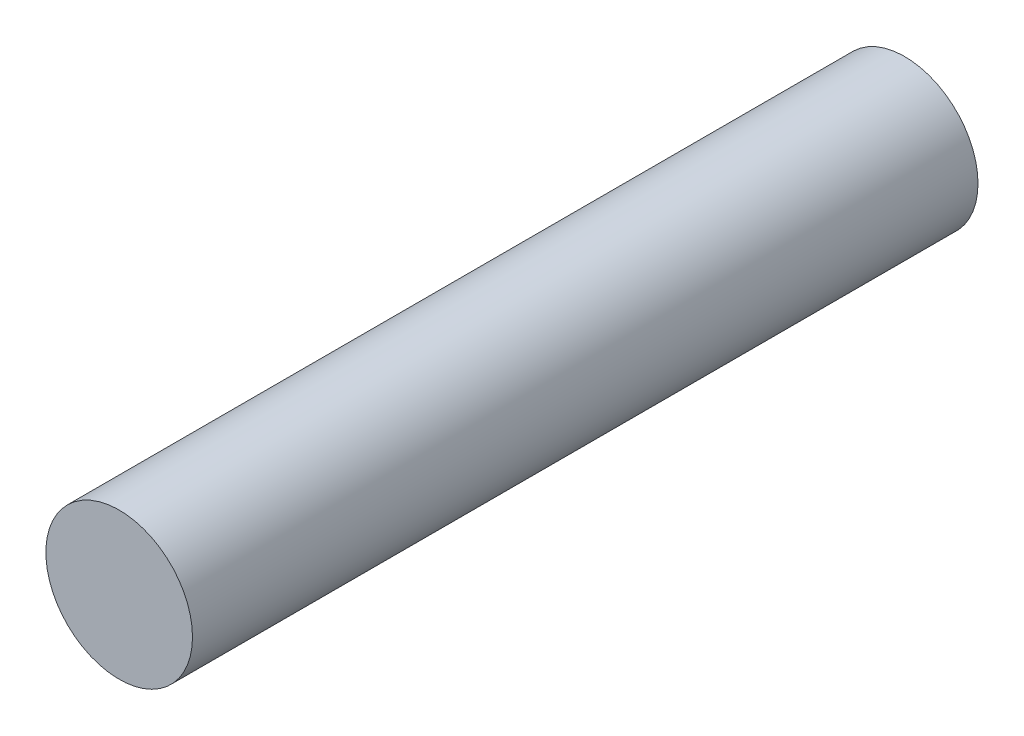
ISO-10303-21;
HEADER;
FILE_DESCRIPTION(('STEP AP214'),'2;1');
FILE_NAME('part.step','',(''),(''),'','','');
FILE_SCHEMA(('AUTOMOTIVE_DESIGN { 1 0 10303 214 1 1 1 1 }'));
ENDSEC;
DATA;
#1=APPLICATION_CONTEXT('core data for automotive mechanical design processes');
#2=APPLICATION_PROTOCOL_DEFINITION('international standard','automotive_design',2000,#1);
#3=PRODUCT_CONTEXT('',#1,'mechanical');
#4=PRODUCT('Part','Part','',(#3));
#5=PRODUCT_RELATED_PRODUCT_CATEGORY('part','',(#4));
#6=PRODUCT_DEFINITION_FORMATION('','',#4);
#7=PRODUCT_DEFINITION_CONTEXT('part definition',#1,'design');
#8=PRODUCT_DEFINITION('design','',#6,#7);
#9=PRODUCT_DEFINITION_SHAPE('','',#8);
#10=(LENGTH_UNIT() NAMED_UNIT(*) SI_UNIT(.MILLI.,.METRE.));
#11=(NAMED_UNIT(*) PLANE_ANGLE_UNIT() SI_UNIT($,.RADIAN.));
#12=(NAMED_UNIT(*) SI_UNIT($,.STERADIAN.) SOLID_ANGLE_UNIT());
#13=UNCERTAINTY_MEASURE_WITH_UNIT(LENGTH_MEASURE(1.E-05),#10,'distance_accuracy_value','');
#14=(GEOMETRIC_REPRESENTATION_CONTEXT(3) GLOBAL_UNCERTAINTY_ASSIGNED_CONTEXT((#13)) GLOBAL_UNIT_ASSIGNED_CONTEXT((#10,
#11,#12)) REPRESENTATION_CONTEXT('',''));
#15=CARTESIAN_POINT('',(0.,0.,0.));
#16=DIRECTION('',(0.,0.,1.));
#17=DIRECTION('',(1.,0.,0.));
#18=AXIS2_PLACEMENT_3D('',#15,#16,#17);
#19=CARTESIAN_POINT('',(0.,0.,75.));
#20=DIRECTION('',(0.,0.,-1.));
#21=DIRECTION('',(-1.,0.,0.));
#22=AXIS2_PLACEMENT_3D('',#19,#20,#21);
#23=CYLINDRICAL_SURFACE('',#22,7.);
#24=CARTESIAN_POINT('',(0.,0.,75.));
#25=DIRECTION('',(0.,0.,1.));
#26=DIRECTION('',(1.,0.,0.));
#27=AXIS2_PLACEMENT_3D('',#24,#25,#26);
#28=CIRCLE('',#27,7.);
#29=CARTESIAN_POINT('',(7.,0.,75.));
#30=VERTEX_POINT('',#29);
#31=EDGE_CURVE('E10',#30,#30,#28,.T.);
#32=ORIENTED_EDGE('',*,*,#31,.F.);
#33=EDGE_LOOP('',(#32));
#34=FACE_BOUND('',#33,.T.);
#35=CARTESIAN_POINT('',(0.,0.,0.));
#36=DIRECTION('',(0.,0.,1.));
#37=DIRECTION('',(1.,0.,0.));
#38=AXIS2_PLACEMENT_3D('',#35,#36,#37);
#39=CIRCLE('',#38,7.);
#40=CARTESIAN_POINT('',(7.,0.,0.));
#41=VERTEX_POINT('',#40);
#42=EDGE_CURVE('E44',#41,#41,#39,.T.);
#43=ORIENTED_EDGE('',*,*,#42,.T.);
#44=EDGE_LOOP('',(#43));
#45=FACE_BOUND('',#44,.T.);
#46=ADVANCED_FACE('F45',(#34,#45),#23,.T.);
#47=CARTESIAN_POINT('',(0.,0.,75.));
#48=DIRECTION('',(0.,0.,1.));
#49=DIRECTION('',(1.,0.,0.));
#50=AXIS2_PLACEMENT_3D('',#47,#48,#49);
#51=PLANE('',#50);
#52=ORIENTED_EDGE('',*,*,#31,.T.);
#53=EDGE_LOOP('',(#52));
#54=FACE_BOUND('',#53,.T.);
#55=ADVANCED_FACE('F56',(#54),#51,.T.);
#56=CARTESIAN_POINT('',(0.,0.,0.));
#57=DIRECTION('',(0.,0.,1.));
#58=DIRECTION('',(1.,0.,0.));
#59=AXIS2_PLACEMENT_3D('',#56,#57,#58);
#60=PLANE('',#59);
#61=ORIENTED_EDGE('',*,*,#42,.F.);
#62=EDGE_LOOP('',(#61));
#63=FACE_BOUND('',#62,.T.);
#64=ADVANCED_FACE('F60',(#63),#60,.F.);
#65=CLOSED_SHELL('',(#46,#55,#64));
#66=MANIFOLD_SOLID_BREP('B2',#65);
#67=ADVANCED_BREP_SHAPE_REPRESENTATION('',(#18,#66),#14);
#68=SHAPE_DEFINITION_REPRESENTATION(#9,#67);
ENDSEC;
END-ISO-10303-21;
